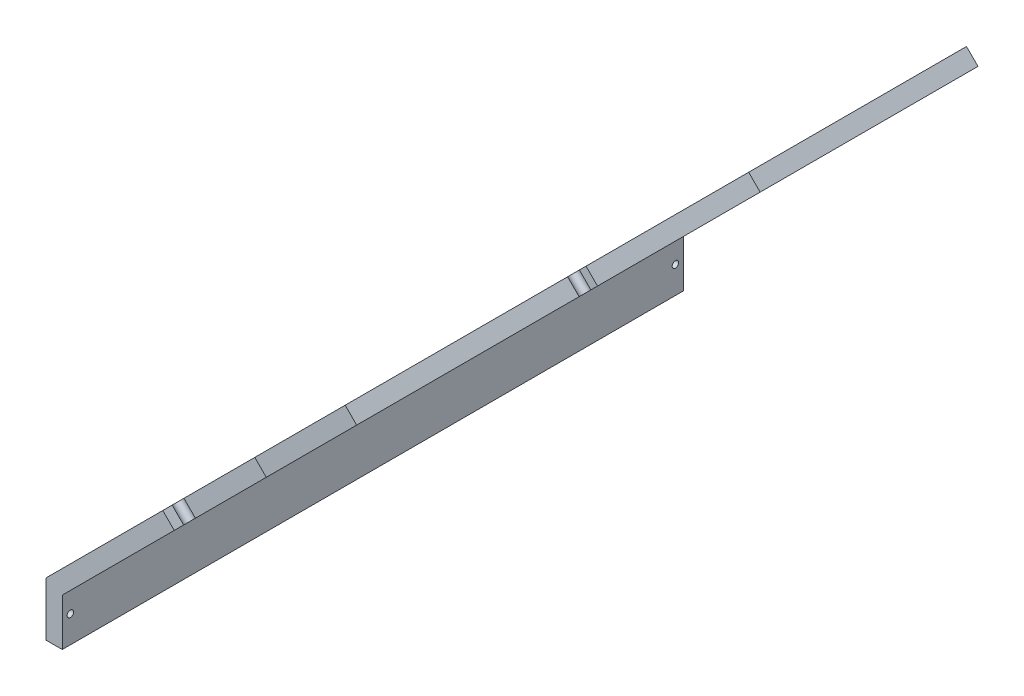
from build123d import *

# Parameters (mm, degrees)
BOSS_EXTRU_1_DEPTH      = 191
ESQUISSE3_W             = 50
ESQUISSE3_H             = 5
BOSS_EXTRU_2_DEPTH      = 5
ESQUISSE2_R             = 1.5
ESQUISSE2_R_2           = 1
ENL_V_MAT_EXTRU_1_DEPTH = 241.267114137
ESQUISSE5_R             = 1
ENL_V_MAT_EXTRU_2_DEPTH = 5


with BuildPart() as part:
    # Esquisse1 → Boss.-Extru.1 (new body)
    with BuildSketch(Plane.XY):
        Polygon((0, 0), (-5, 0), (-5, 16.571067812), (86.967063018, 108.53813083), (90.502596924, 105.002596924), (0, 14.5), align=None)
    extrude(amount=BOSS_EXTRU_1_DEPTH)

    # Esquisse3 → Boss.-Extru.2 (add)
    with BuildSketch(Plane(origin=(-10.785533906, 10.785533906, 0), x_dir=(0, 0, 1), z_dir=(-0.7071067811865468, 0.7071067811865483, 0))):
        with Locations((95.5, 140.743048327)):
            Rectangle(ESQUISSE3_W, ESQUISSE3_H)
    extrude(amount=-BOSS_EXTRU_2_DEPTH)

    # Esquisse2 → Enl_v. mat.-Extru.1 (cut, through all)
    with BuildSketch(Plane(origin=(-10.785533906, 10.785533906, 0), x_dir=(0, 0, 1), z_dir=(-0.7071067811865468, 0.7071067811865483, 0))):
        with Locations((69.439339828, 139.303708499)):
            Circle(ESQUISSE2_R)
        with Locations((121.560660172, 139.303708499)):
            Circle(ESQUISSE2_R)
        with Locations(Location((95.5, 140.743048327, 0), (0, 0, 270))):
            Circle(ESQUISSE2_R_2)
        with Locations(Location((188.5, 118.594765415, 0), (0, 0, 270))):
            Circle(ESQUISSE2_R_2)
        with Locations(Location((188.5, 33.564231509, 0), (0, 0, 270))):
            Circle(ESQUISSE2_R_2)
        with Locations(Location((2.5, 33.564231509, 0), (0, 0, 270))):
            Circle(ESQUISSE2_R_2)
        with Locations(Location((2.5, 118.594765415, 0), (0, 0, 270))):
            Circle(ESQUISSE2_R_2)
        with BuildLine():
            Line((2.878679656, 58.946482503), (0, 58.946482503))
            Line((0, 58.946482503), (0, 98.946482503))
            Line((0, 98.946482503), (2.878679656, 98.946482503))
            ThreePointArc((2.878679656, 98.946482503), (5, 98.946482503), (5, 96.82516216))
            Line((5, 96.82516216), (5, 61.067802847))
            ThreePointArc((5, 61.067802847), (5, 58.946482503), (2.878679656, 58.946482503))
        make_face()
        with BuildLine():
            Line((188.121320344, 98.946482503), (191, 98.946482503))
            Line((191, 98.946482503), (191, 58.946482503))
            Line((191, 58.946482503), (188.121320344, 58.946482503))
            ThreePointArc((188.121320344, 58.946482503), (186, 58.946482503), (186, 61.067802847))
            Line((186, 61.067802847), (186, 96.82516216))
            ThreePointArc((186, 96.82516216), (186, 98.946482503), (188.121320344, 98.946482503))
        make_face()
    extrude(amount=-ENL_V_MAT_EXTRU_1_DEPTH, mode=Mode.SUBTRACT)

    # Esquisse5 → Enl_v. mat.-Extru.2 (cut)
    with BuildSketch(Plane.ZY.offset(5)):
        with Locations(Location((2.5, 8.285533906, 0), (0, 0, 270))):
            Circle(ESQUISSE5_R)
        with Locations(Location((188.5, 8.285533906, 0), (0, 0, 270))):
            Circle(ESQUISSE5_R)
    extrude(amount=-ENL_V_MAT_EXTRU_2_DEPTH, mode=Mode.SUBTRACT)


solid = part.part
